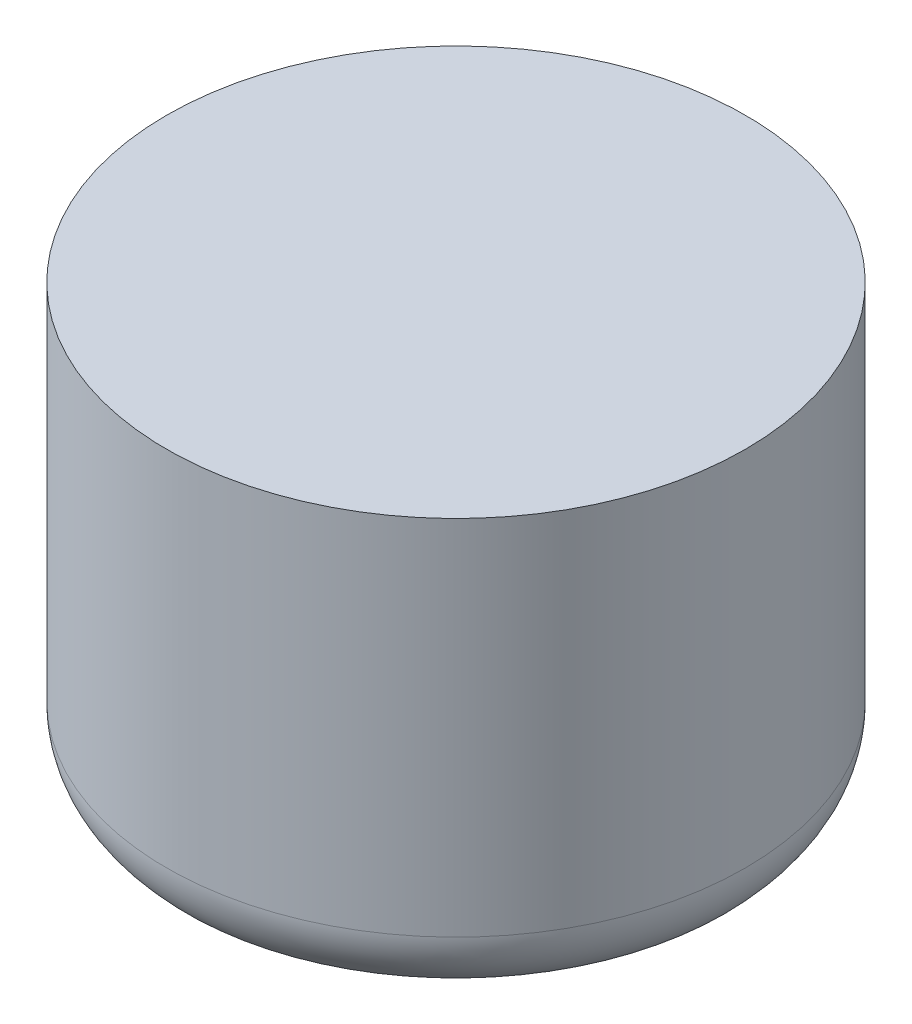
from build123d import *


with BuildPart() as part:
    # Esquisse1 → R_volution1 (revolve)
    with BuildSketch(Plane.XY):
        with BuildLine():
            Line((-120.008687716, 54.638906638), (-120.008687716, 116.148906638))
            Line((-120.008687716, 116.148906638), (-70.918687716, 116.148906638))
            Line((-70.918687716, 116.148906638), (-70.918687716, 46.148906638))
            Line((-70.918687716, 46.148906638), (-116.489247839, 46.148906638))
            ThreePointArc((-116.489247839, 46.148906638), (-119.093964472, 50.043622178), (-120.008687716, 54.638906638))
        make_face()
    revolve(axis=Axis((-70.918687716, 164.899410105, 0), (0, -1, 0)))


solid = part.part
